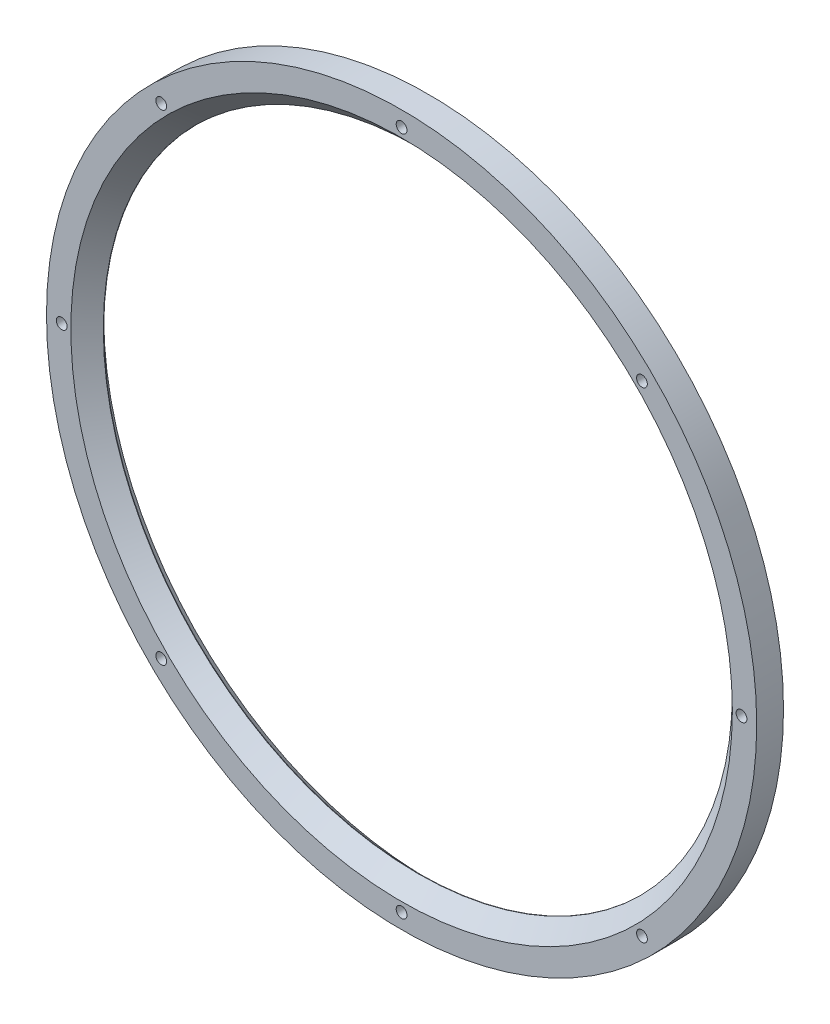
from build123d import *

# Parameters (mm, degrees)
CSK_FOR_1_4_FLAT_HEAD_MACHINE_SCREW_100_D           = 6.7564
CSK_FOR_1_4_FLAT_HEAD_MACHINE_SCREW_100_CSINK_D     = 12.8778
CSK_FOR_1_4_FLAT_HEAD_MACHINE_SCREW_100_CSINK_ANGLE = 100
CIRPATTERN1_COUNT                                   = 8


with BuildPart() as part:
    # Sketch1 → Revolve1 (revolve)
    with BuildSketch(Plane(origin=(0, 0, 0), x_dir=(1, 0, 0), z_dir=(0, 1, 0))):
        Polygon((207.01, 0), (222.25, 0), (222.25, 16.764), (203.2, 16.764), (196.85, 10.414), (196.85, 10.16), align=None)
    revolve(axis=Axis((0, 0, 0), (0, 0, -1)))

    # CSK for 1_4 Flat Head Machine Screw _100 (through all)
    with Locations(Plane(origin=(0, 0, -16.764), x_dir=(-1, 0, 0), z_dir=(0, 0, -1))):
        with Locations((0, 212.725)):
            csk_for_1_4_flat_head_machine_screw_100 = CounterSinkHole(CSK_FOR_1_4_FLAT_HEAD_MACHINE_SCREW_100_D / 2, CSK_FOR_1_4_FLAT_HEAD_MACHINE_SCREW_100_CSINK_D / 2, counter_sink_angle=CSK_FOR_1_4_FLAT_HEAD_MACHINE_SCREW_100_CSINK_ANGLE)

    # CirPattern1: CSK for 1_4 Flat Head Machine Screw _100 ×8 about axis
    cirpattern1_axis = Axis((0, 0, 0), (0, 0, 1))
    for i in range(1, CIRPATTERN1_COUNT):
        add(csk_for_1_4_flat_head_machine_screw_100.rotate(cirpattern1_axis, i * 360 / CIRPATTERN1_COUNT), mode=Mode.SUBTRACT)


solid = part.part
